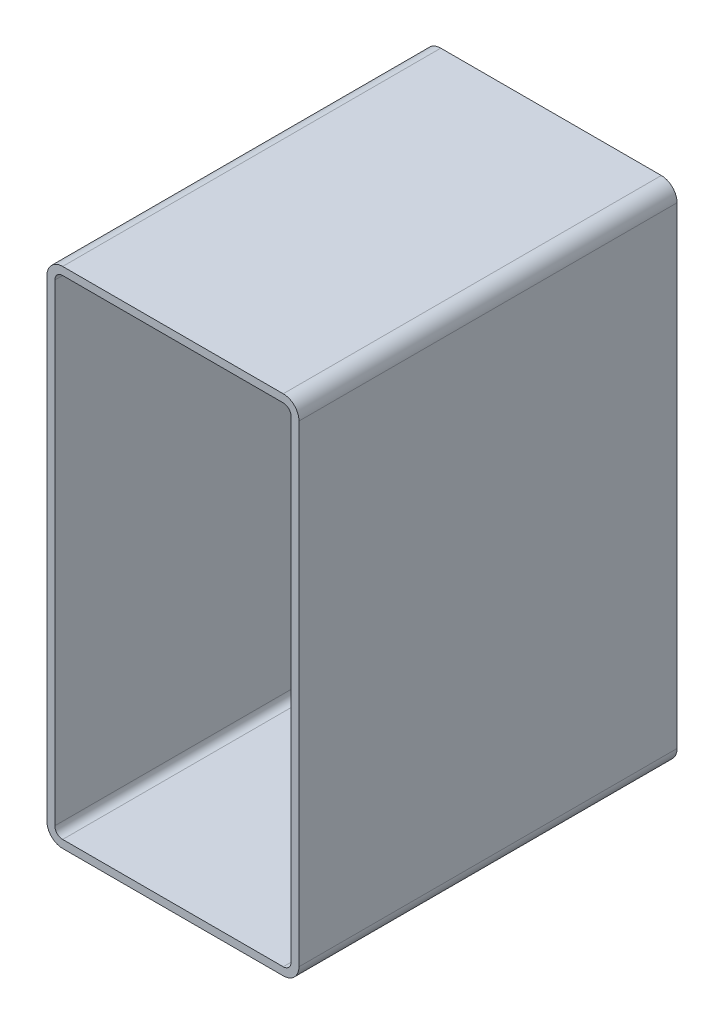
ISO-10303-21;
HEADER;
FILE_DESCRIPTION(('STEP AP214'),'2;1');
FILE_NAME('part.step','',(''),(''),'','','');
FILE_SCHEMA(('AUTOMOTIVE_DESIGN { 1 0 10303 214 1 1 1 1 }'));
ENDSEC;
DATA;
#1=APPLICATION_CONTEXT('core data for automotive mechanical design processes');
#2=APPLICATION_PROTOCOL_DEFINITION('international standard','automotive_design',2000,#1);
#3=PRODUCT_CONTEXT('',#1,'mechanical');
#4=PRODUCT('Part','Part','',(#3));
#5=PRODUCT_RELATED_PRODUCT_CATEGORY('part','',(#4));
#6=PRODUCT_DEFINITION_FORMATION('','',#4);
#7=PRODUCT_DEFINITION_CONTEXT('part definition',#1,'design');
#8=PRODUCT_DEFINITION('design','',#6,#7);
#9=PRODUCT_DEFINITION_SHAPE('','',#8);
#10=(LENGTH_UNIT() NAMED_UNIT(*) SI_UNIT(.MILLI.,.METRE.));
#11=(NAMED_UNIT(*) PLANE_ANGLE_UNIT() SI_UNIT($,.RADIAN.));
#12=(NAMED_UNIT(*) SI_UNIT($,.STERADIAN.) SOLID_ANGLE_UNIT());
#13=UNCERTAINTY_MEASURE_WITH_UNIT(LENGTH_MEASURE(1.E-05),#10,'distance_accuracy_value','');
#14=(GEOMETRIC_REPRESENTATION_CONTEXT(3) GLOBAL_UNCERTAINTY_ASSIGNED_CONTEXT((#13)) GLOBAL_UNIT_ASSIGNED_CONTEXT((#10,
#11,#12)) REPRESENTATION_CONTEXT('',''));
#15=CARTESIAN_POINT('',(0.,0.,0.));
#16=DIRECTION('',(0.,0.,1.));
#17=DIRECTION('',(1.,0.,0.));
#18=AXIS2_PLACEMENT_3D('',#15,#16,#17);
#19=CARTESIAN_POINT('',(14.0909404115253,395.482862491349,304.8));
#20=DIRECTION('',(0.,0.,1.));
#21=DIRECTION('',(1.,0.,0.));
#22=AXIS2_PLACEMENT_3D('',#19,#20,#21);
#23=PLANE('',#22);
#24=CARTESIAN_POINT('',(14.0909404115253,395.482862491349,304.8));
#25=DIRECTION('',(0.,0.,1.));
#26=DIRECTION('',(1.,0.,0.));
#27=AXIS2_PLACEMENT_3D('',#24,#25,#26);
#28=CIRCLE('',#27,12.7);
#29=CARTESIAN_POINT('',(14.0909404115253,408.182862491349,304.8));
#30=VERTEX_POINT('',#29);
#31=CARTESIAN_POINT('',(1.3909404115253,395.482862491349,304.8));
#32=VERTEX_POINT('',#31);
#33=EDGE_CURVE('E211',#30,#32,#28,.T.);
#34=ORIENTED_EDGE('',*,*,#33,.T.);
#35=DIRECTION('',(0.,-1.,0.));
#36=VECTOR('',#35,1.);
#37=CARTESIAN_POINT('',(1.3909404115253,14.4828624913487,304.8));
#38=LINE('',#37,#36);
#39=CARTESIAN_POINT('',(1.3909404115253,14.4828624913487,304.8));
#40=VERTEX_POINT('',#39);
#41=EDGE_CURVE('E214',#32,#40,#38,.T.);
#42=ORIENTED_EDGE('',*,*,#41,.T.);
#43=CARTESIAN_POINT('',(14.0909404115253,14.4828624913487,304.8));
#44=DIRECTION('',(0.,0.,1.));
#45=DIRECTION('',(1.,0.,0.));
#46=AXIS2_PLACEMENT_3D('',#43,#44,#45);
#47=CIRCLE('',#46,12.7);
#48=CARTESIAN_POINT('',(14.0909404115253,1.78286249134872,304.8));
#49=VERTEX_POINT('',#48);
#50=EDGE_CURVE('E217',#40,#49,#47,.T.);
#51=ORIENTED_EDGE('',*,*,#50,.T.);
#52=DIRECTION('',(1.,0.,0.));
#53=VECTOR('',#52,1.);
#54=CARTESIAN_POINT('',(191.890940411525,1.78286249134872,304.8));
#55=LINE('',#54,#53);
#56=CARTESIAN_POINT('',(191.890940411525,1.78286249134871,304.8));
#57=VERTEX_POINT('',#56);
#58=EDGE_CURVE('E219',#49,#57,#55,.T.);
#59=ORIENTED_EDGE('',*,*,#58,.T.);
#60=CARTESIAN_POINT('',(191.890940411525,14.4828624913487,304.8));
#61=DIRECTION('',(0.,0.,1.));
#62=DIRECTION('',(1.,0.,0.));
#63=AXIS2_PLACEMENT_3D('',#60,#61,#62);
#64=CIRCLE('',#63,12.7);
#65=CARTESIAN_POINT('',(204.590940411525,14.4828624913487,304.8));
#66=VERTEX_POINT('',#65);
#67=EDGE_CURVE('E221',#57,#66,#64,.T.);
#68=ORIENTED_EDGE('',*,*,#67,.T.);
#69=DIRECTION('',(0.,1.,0.));
#70=VECTOR('',#69,1.);
#71=CARTESIAN_POINT('',(204.590940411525,395.482862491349,304.8));
#72=LINE('',#71,#70);
#73=CARTESIAN_POINT('',(204.590940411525,395.482862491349,304.8));
#74=VERTEX_POINT('',#73);
#75=EDGE_CURVE('E223',#66,#74,#72,.T.);
#76=ORIENTED_EDGE('',*,*,#75,.T.);
#77=CARTESIAN_POINT('',(191.890940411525,395.482862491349,304.8));
#78=DIRECTION('',(0.,0.,1.));
#79=DIRECTION('',(1.,0.,0.));
#80=AXIS2_PLACEMENT_3D('',#77,#78,#79);
#81=CIRCLE('',#80,12.7);
#82=CARTESIAN_POINT('',(191.890940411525,408.182862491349,304.8));
#83=VERTEX_POINT('',#82);
#84=EDGE_CURVE('E225',#74,#83,#81,.T.);
#85=ORIENTED_EDGE('',*,*,#84,.T.);
#86=DIRECTION('',(-1.,0.,0.));
#87=VECTOR('',#86,1.);
#88=CARTESIAN_POINT('',(14.0909404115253,408.182862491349,304.8));
#89=LINE('',#88,#87);
#90=EDGE_CURVE('E227',#83,#30,#89,.T.);
#91=ORIENTED_EDGE('',*,*,#90,.T.);
#92=EDGE_LOOP('',(#34,#42,#51,#59,#68,#76,#85,#91));
#93=FACE_BOUND('',#92,.T.);
#94=DIRECTION('',(0.,-1.,0.));
#95=VECTOR('',#94,1.);
#96=CARTESIAN_POINT('',(7.7409404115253,14.4828624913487,304.8));
#97=LINE('',#96,#95);
#98=CARTESIAN_POINT('',(7.7409404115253,395.482862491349,304.8));
#99=VERTEX_POINT('',#98);
#100=CARTESIAN_POINT('',(7.7409404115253,14.4828624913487,304.8));
#101=VERTEX_POINT('',#100);
#102=EDGE_CURVE('E154',#99,#101,#97,.T.);
#103=ORIENTED_EDGE('',*,*,#102,.F.);
#104=CARTESIAN_POINT('',(14.0909404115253,395.482862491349,304.8));
#105=DIRECTION('',(0.,0.,1.));
#106=DIRECTION('',(1.,0.,0.));
#107=AXIS2_PLACEMENT_3D('',#104,#105,#106);
#108=CIRCLE('',#107,6.35000000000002);
#109=CARTESIAN_POINT('',(14.0909404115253,401.832862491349,304.8));
#110=VERTEX_POINT('',#109);
#111=EDGE_CURVE('E146',#110,#99,#108,.T.);
#112=ORIENTED_EDGE('',*,*,#111,.F.);
#113=DIRECTION('',(-1.,0.,0.));
#114=VECTOR('',#113,1.);
#115=CARTESIAN_POINT('',(14.0909404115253,401.832862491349,304.8));
#116=LINE('',#115,#114);
#117=CARTESIAN_POINT('',(191.890940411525,401.832862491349,304.8));
#118=VERTEX_POINT('',#117);
#119=EDGE_CURVE('E179',#118,#110,#116,.T.);
#120=ORIENTED_EDGE('',*,*,#119,.F.);
#121=CARTESIAN_POINT('',(191.890940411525,395.482862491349,304.8));
#122=DIRECTION('',(0.,0.,1.));
#123=DIRECTION('',(1.,0.,0.));
#124=AXIS2_PLACEMENT_3D('',#121,#122,#123);
#125=CIRCLE('',#124,6.35000000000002);
#126=CARTESIAN_POINT('',(198.240940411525,395.482862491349,304.8));
#127=VERTEX_POINT('',#126);
#128=EDGE_CURVE('E177',#127,#118,#125,.T.);
#129=ORIENTED_EDGE('',*,*,#128,.F.);
#130=DIRECTION('',(0.,1.,0.));
#131=VECTOR('',#130,1.);
#132=CARTESIAN_POINT('',(198.240940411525,395.482862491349,304.8));
#133=LINE('',#132,#131);
#134=CARTESIAN_POINT('',(198.240940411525,14.4828624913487,304.8));
#135=VERTEX_POINT('',#134);
#136=EDGE_CURVE('E175',#135,#127,#133,.T.);
#137=ORIENTED_EDGE('',*,*,#136,.F.);
#138=CARTESIAN_POINT('',(191.890940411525,14.4828624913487,304.8));
#139=DIRECTION('',(0.,0.,1.));
#140=DIRECTION('',(1.,0.,0.));
#141=AXIS2_PLACEMENT_3D('',#138,#139,#140);
#142=CIRCLE('',#141,6.35000000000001);
#143=CARTESIAN_POINT('',(191.890940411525,8.13286249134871,304.8));
#144=VERTEX_POINT('',#143);
#145=EDGE_CURVE('E173',#144,#135,#142,.T.);
#146=ORIENTED_EDGE('',*,*,#145,.F.);
#147=DIRECTION('',(1.,0.,0.));
#148=VECTOR('',#147,1.);
#149=CARTESIAN_POINT('',(191.890940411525,8.13286249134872,304.8));
#150=LINE('',#149,#148);
#151=CARTESIAN_POINT('',(14.0909404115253,8.13286249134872,304.8));
#152=VERTEX_POINT('',#151);
#153=EDGE_CURVE('E169',#152,#144,#150,.T.);
#154=ORIENTED_EDGE('',*,*,#153,.F.);
#155=CARTESIAN_POINT('',(14.0909404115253,14.4828624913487,304.8));
#156=DIRECTION('',(0.,0.,1.));
#157=DIRECTION('',(1.,0.,0.));
#158=AXIS2_PLACEMENT_3D('',#155,#156,#157);
#159=CIRCLE('',#158,6.35);
#160=EDGE_CURVE('E167',#101,#152,#159,.T.);
#161=ORIENTED_EDGE('',*,*,#160,.F.);
#162=EDGE_LOOP('',(#103,#112,#120,#129,#137,#146,#154,#161));
#163=FACE_BOUND('',#162,.T.);
#164=ADVANCED_FACE('F33',(#93,#163),#23,.T.);
#165=CARTESIAN_POINT('',(14.0909404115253,395.482862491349,0.));
#166=DIRECTION('',(0.,0.,1.));
#167=DIRECTION('',(1.,0.,0.));
#168=AXIS2_PLACEMENT_3D('',#165,#166,#167);
#169=PLANE('',#168);
#170=CARTESIAN_POINT('',(14.0909404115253,395.482862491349,0.));
#171=DIRECTION('',(0.,0.,1.));
#172=DIRECTION('',(1.,0.,0.));
#173=AXIS2_PLACEMENT_3D('',#170,#171,#172);
#174=CIRCLE('',#173,12.7);
#175=CARTESIAN_POINT('',(14.0909404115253,408.182862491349,0.));
#176=VERTEX_POINT('',#175);
#177=CARTESIAN_POINT('',(1.3909404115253,395.482862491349,0.));
#178=VERTEX_POINT('',#177);
#179=EDGE_CURVE('E162',#176,#178,#174,.T.);
#180=ORIENTED_EDGE('',*,*,#179,.F.);
#181=DIRECTION('',(-1.,0.,0.));
#182=VECTOR('',#181,1.);
#183=CARTESIAN_POINT('',(14.0909404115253,408.182862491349,0.));
#184=LINE('',#183,#182);
#185=CARTESIAN_POINT('',(191.890940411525,408.182862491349,0.));
#186=VERTEX_POINT('',#185);
#187=EDGE_CURVE('E215',#186,#176,#184,.T.);
#188=ORIENTED_EDGE('',*,*,#187,.F.);
#189=CARTESIAN_POINT('',(191.890940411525,395.482862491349,0.));
#190=DIRECTION('',(0.,0.,1.));
#191=DIRECTION('',(1.,0.,0.));
#192=AXIS2_PLACEMENT_3D('',#189,#190,#191);
#193=CIRCLE('',#192,12.7);
#194=CARTESIAN_POINT('',(204.590940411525,395.482862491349,0.));
#195=VERTEX_POINT('',#194);
#196=EDGE_CURVE('E242',#195,#186,#193,.T.);
#197=ORIENTED_EDGE('',*,*,#196,.F.);
#198=DIRECTION('',(0.,1.,0.));
#199=VECTOR('',#198,1.);
#200=CARTESIAN_POINT('',(204.590940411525,395.482862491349,0.));
#201=LINE('',#200,#199);
#202=CARTESIAN_POINT('',(204.590940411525,14.4828624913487,0.));
#203=VERTEX_POINT('',#202);
#204=EDGE_CURVE('E240',#203,#195,#201,.T.);
#205=ORIENTED_EDGE('',*,*,#204,.F.);
#206=CARTESIAN_POINT('',(191.890940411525,14.4828624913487,0.));
#207=DIRECTION('',(0.,0.,1.));
#208=DIRECTION('',(1.,0.,0.));
#209=AXIS2_PLACEMENT_3D('',#206,#207,#208);
#210=CIRCLE('',#209,12.7);
#211=CARTESIAN_POINT('',(191.890940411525,1.78286249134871,0.));
#212=VERTEX_POINT('',#211);
#213=EDGE_CURVE('E238',#212,#203,#210,.T.);
#214=ORIENTED_EDGE('',*,*,#213,.F.);
#215=DIRECTION('',(1.,0.,0.));
#216=VECTOR('',#215,1.);
#217=CARTESIAN_POINT('',(191.890940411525,1.78286249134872,0.));
#218=LINE('',#217,#216);
#219=CARTESIAN_POINT('',(14.0909404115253,1.78286249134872,0.));
#220=VERTEX_POINT('',#219);
#221=EDGE_CURVE('E236',#220,#212,#218,.T.);
#222=ORIENTED_EDGE('',*,*,#221,.F.);
#223=CARTESIAN_POINT('',(14.0909404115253,14.4828624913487,0.));
#224=DIRECTION('',(0.,0.,1.));
#225=DIRECTION('',(1.,0.,0.));
#226=AXIS2_PLACEMENT_3D('',#223,#224,#225);
#227=CIRCLE('',#226,12.7);
#228=CARTESIAN_POINT('',(1.3909404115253,14.4828624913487,0.));
#229=VERTEX_POINT('',#228);
#230=EDGE_CURVE('E234',#229,#220,#227,.T.);
#231=ORIENTED_EDGE('',*,*,#230,.F.);
#232=DIRECTION('',(0.,-1.,0.));
#233=VECTOR('',#232,1.);
#234=CARTESIAN_POINT('',(1.3909404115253,14.4828624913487,0.));
#235=LINE('',#234,#233);
#236=EDGE_CURVE('E232',#178,#229,#235,.T.);
#237=ORIENTED_EDGE('',*,*,#236,.F.);
#238=EDGE_LOOP('',(#180,#188,#197,#205,#214,#222,#231,#237));
#239=FACE_BOUND('',#238,.T.);
#240=CARTESIAN_POINT('',(14.0909404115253,395.482862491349,0.));
#241=DIRECTION('',(0.,0.,1.));
#242=DIRECTION('',(1.,0.,0.));
#243=AXIS2_PLACEMENT_3D('',#240,#241,#242);
#244=CIRCLE('',#243,6.35000000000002);
#245=CARTESIAN_POINT('',(14.0909404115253,401.832862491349,0.));
#246=VERTEX_POINT('',#245);
#247=CARTESIAN_POINT('',(7.7409404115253,395.482862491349,0.));
#248=VERTEX_POINT('',#247);
#249=EDGE_CURVE('E56',#246,#248,#244,.T.);
#250=ORIENTED_EDGE('',*,*,#249,.T.);
#251=DIRECTION('',(0.,-1.,0.));
#252=VECTOR('',#251,1.);
#253=CARTESIAN_POINT('',(7.7409404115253,14.4828624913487,0.));
#254=LINE('',#253,#252);
#255=CARTESIAN_POINT('',(7.7409404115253,14.4828624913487,0.));
#256=VERTEX_POINT('',#255);
#257=EDGE_CURVE('E161',#248,#256,#254,.T.);
#258=ORIENTED_EDGE('',*,*,#257,.T.);
#259=CARTESIAN_POINT('',(14.0909404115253,14.4828624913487,0.));
#260=DIRECTION('',(0.,0.,1.));
#261=DIRECTION('',(1.,0.,0.));
#262=AXIS2_PLACEMENT_3D('',#259,#260,#261);
#263=CIRCLE('',#262,6.35);
#264=CARTESIAN_POINT('',(14.0909404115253,8.13286249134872,0.));
#265=VERTEX_POINT('',#264);
#266=EDGE_CURVE('E183',#256,#265,#263,.T.);
#267=ORIENTED_EDGE('',*,*,#266,.T.);
#268=DIRECTION('',(1.,0.,0.));
#269=VECTOR('',#268,1.);
#270=CARTESIAN_POINT('',(191.890940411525,8.13286249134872,0.));
#271=LINE('',#270,#269);
#272=CARTESIAN_POINT('',(191.890940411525,8.13286249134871,0.));
#273=VERTEX_POINT('',#272);
#274=EDGE_CURVE('E186',#265,#273,#271,.T.);
#275=ORIENTED_EDGE('',*,*,#274,.T.);
#276=CARTESIAN_POINT('',(191.890940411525,14.4828624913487,0.));
#277=DIRECTION('',(0.,0.,1.));
#278=DIRECTION('',(1.,0.,0.));
#279=AXIS2_PLACEMENT_3D('',#276,#277,#278);
#280=CIRCLE('',#279,6.35000000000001);
#281=CARTESIAN_POINT('',(198.240940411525,14.4828624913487,0.));
#282=VERTEX_POINT('',#281);
#283=EDGE_CURVE('E189',#273,#282,#280,.T.);
#284=ORIENTED_EDGE('',*,*,#283,.T.);
#285=DIRECTION('',(0.,1.,0.));
#286=VECTOR('',#285,1.);
#287=CARTESIAN_POINT('',(198.240940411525,395.482862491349,0.));
#288=LINE('',#287,#286);
#289=CARTESIAN_POINT('',(198.240940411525,395.482862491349,0.));
#290=VERTEX_POINT('',#289);
#291=EDGE_CURVE('E192',#282,#290,#288,.T.);
#292=ORIENTED_EDGE('',*,*,#291,.T.);
#293=CARTESIAN_POINT('',(191.890940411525,395.482862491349,0.));
#294=DIRECTION('',(0.,0.,1.));
#295=DIRECTION('',(1.,0.,0.));
#296=AXIS2_PLACEMENT_3D('',#293,#294,#295);
#297=CIRCLE('',#296,6.35000000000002);
#298=CARTESIAN_POINT('',(191.890940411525,401.832862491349,0.));
#299=VERTEX_POINT('',#298);
#300=EDGE_CURVE('E195',#290,#299,#297,.T.);
#301=ORIENTED_EDGE('',*,*,#300,.T.);
#302=DIRECTION('',(-1.,0.,0.));
#303=VECTOR('',#302,1.);
#304=CARTESIAN_POINT('',(14.0909404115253,401.832862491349,0.));
#305=LINE('',#304,#303);
#306=EDGE_CURVE('E155',#299,#246,#305,.T.);
#307=ORIENTED_EDGE('',*,*,#306,.T.);
#308=EDGE_LOOP('',(#250,#258,#267,#275,#284,#292,#301,#307));
#309=FACE_BOUND('',#308,.T.);
#310=ADVANCED_FACE('F272',(#239,#309),#169,.F.);
#311=CARTESIAN_POINT('',(14.0909404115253,395.482862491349,304.8));
#312=DIRECTION('',(0.,0.,-1.));
#313=DIRECTION('',(-1.,0.,0.));
#314=AXIS2_PLACEMENT_3D('',#311,#312,#313);
#315=CYLINDRICAL_SURFACE('',#314,12.7);
#316=ORIENTED_EDGE('',*,*,#179,.T.);
#317=DIRECTION('',(0.,0.,-1.));
#318=VECTOR('',#317,1.);
#319=CARTESIAN_POINT('',(1.3909404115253,395.482862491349,304.8));
#320=LINE('',#319,#318);
#321=EDGE_CURVE('E11',#32,#178,#320,.T.);
#322=ORIENTED_EDGE('',*,*,#321,.F.);
#323=ORIENTED_EDGE('',*,*,#33,.F.);
#324=DIRECTION('',(0.,0.,-1.));
#325=VECTOR('',#324,1.);
#326=CARTESIAN_POINT('',(14.0909404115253,408.182862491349,304.8));
#327=LINE('',#326,#325);
#328=EDGE_CURVE('E229',#30,#176,#327,.T.);
#329=ORIENTED_EDGE('',*,*,#328,.T.);
#330=EDGE_LOOP('',(#316,#322,#323,#329));
#331=FACE_BOUND('',#330,.T.);
#332=ADVANCED_FACE('F35',(#331),#315,.T.);
#333=CARTESIAN_POINT('',(1.3909404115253,14.4828624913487,304.8));
#334=DIRECTION('',(1.,0.,0.));
#335=DIRECTION('',(0.,0.,-1.));
#336=AXIS2_PLACEMENT_3D('',#333,#334,#335);
#337=PLANE('',#336);
#338=ORIENTED_EDGE('',*,*,#236,.T.);
#339=DIRECTION('',(0.,0.,-1.));
#340=VECTOR('',#339,1.);
#341=CARTESIAN_POINT('',(1.3909404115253,14.4828624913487,304.8));
#342=LINE('',#341,#340);
#343=EDGE_CURVE('E41',#40,#229,#342,.T.);
#344=ORIENTED_EDGE('',*,*,#343,.F.);
#345=ORIENTED_EDGE('',*,*,#41,.F.);
#346=ORIENTED_EDGE('',*,*,#321,.T.);
#347=EDGE_LOOP('',(#338,#344,#345,#346));
#348=FACE_BOUND('',#347,.T.);
#349=ADVANCED_FACE('F289',(#348),#337,.F.);
#350=CARTESIAN_POINT('',(14.0909404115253,14.4828624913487,304.8));
#351=DIRECTION('',(0.,0.,-1.));
#352=DIRECTION('',(-1.,0.,0.));
#353=AXIS2_PLACEMENT_3D('',#350,#351,#352);
#354=CYLINDRICAL_SURFACE('',#353,12.7);
#355=ORIENTED_EDGE('',*,*,#230,.T.);
#356=DIRECTION('',(0.,0.,-1.));
#357=VECTOR('',#356,1.);
#358=CARTESIAN_POINT('',(14.0909404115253,1.78286249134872,304.8));
#359=LINE('',#358,#357);
#360=EDGE_CURVE('E259',#49,#220,#359,.T.);
#361=ORIENTED_EDGE('',*,*,#360,.F.);
#362=ORIENTED_EDGE('',*,*,#50,.F.);
#363=ORIENTED_EDGE('',*,*,#343,.T.);
#364=EDGE_LOOP('',(#355,#361,#362,#363));
#365=FACE_BOUND('',#364,.T.);
#366=ADVANCED_FACE('F266',(#365),#354,.T.);
#367=CARTESIAN_POINT('',(191.890940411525,1.78286249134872,304.8));
#368=DIRECTION('',(0.,1.,0.));
#369=DIRECTION('',(0.,0.,1.));
#370=AXIS2_PLACEMENT_3D('',#367,#368,#369);
#371=PLANE('',#370);
#372=ORIENTED_EDGE('',*,*,#221,.T.);
#373=DIRECTION('',(0.,0.,-1.));
#374=VECTOR('',#373,1.);
#375=CARTESIAN_POINT('',(191.890940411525,1.78286249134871,304.8));
#376=LINE('',#375,#374);
#377=EDGE_CURVE('E256',#57,#212,#376,.T.);
#378=ORIENTED_EDGE('',*,*,#377,.F.);
#379=ORIENTED_EDGE('',*,*,#58,.F.);
#380=ORIENTED_EDGE('',*,*,#360,.T.);
#381=EDGE_LOOP('',(#372,#378,#379,#380));
#382=FACE_BOUND('',#381,.T.);
#383=ADVANCED_FACE('F278',(#382),#371,.F.);
#384=CARTESIAN_POINT('',(191.890940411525,14.4828624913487,304.8));
#385=DIRECTION('',(0.,0.,-1.));
#386=DIRECTION('',(-1.,0.,0.));
#387=AXIS2_PLACEMENT_3D('',#384,#385,#386);
#388=CYLINDRICAL_SURFACE('',#387,12.7);
#389=ORIENTED_EDGE('',*,*,#213,.T.);
#390=DIRECTION('',(0.,0.,-1.));
#391=VECTOR('',#390,1.);
#392=CARTESIAN_POINT('',(204.590940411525,14.4828624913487,304.8));
#393=LINE('',#392,#391);
#394=EDGE_CURVE('E253',#66,#203,#393,.T.);
#395=ORIENTED_EDGE('',*,*,#394,.F.);
#396=ORIENTED_EDGE('',*,*,#67,.F.);
#397=ORIENTED_EDGE('',*,*,#377,.T.);
#398=EDGE_LOOP('',(#389,#395,#396,#397));
#399=FACE_BOUND('',#398,.T.);
#400=ADVANCED_FACE('F282',(#399),#388,.T.);
#401=CARTESIAN_POINT('',(204.590940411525,395.482862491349,304.8));
#402=DIRECTION('',(-1.,0.,0.));
#403=DIRECTION('',(0.,0.,1.));
#404=AXIS2_PLACEMENT_3D('',#401,#402,#403);
#405=PLANE('',#404);
#406=ORIENTED_EDGE('',*,*,#204,.T.);
#407=DIRECTION('',(0.,0.,-1.));
#408=VECTOR('',#407,1.);
#409=CARTESIAN_POINT('',(204.590940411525,395.482862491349,304.8));
#410=LINE('',#409,#408);
#411=EDGE_CURVE('E250',#74,#195,#410,.T.);
#412=ORIENTED_EDGE('',*,*,#411,.F.);
#413=ORIENTED_EDGE('',*,*,#75,.F.);
#414=ORIENTED_EDGE('',*,*,#394,.T.);
#415=EDGE_LOOP('',(#406,#412,#413,#414));
#416=FACE_BOUND('',#415,.T.);
#417=ADVANCED_FACE('F302',(#416),#405,.F.);
#418=CARTESIAN_POINT('',(191.890940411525,395.482862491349,304.8));
#419=DIRECTION('',(0.,0.,-1.));
#420=DIRECTION('',(-1.,0.,0.));
#421=AXIS2_PLACEMENT_3D('',#418,#419,#420);
#422=CYLINDRICAL_SURFACE('',#421,12.7);
#423=ORIENTED_EDGE('',*,*,#196,.T.);
#424=DIRECTION('',(0.,0.,-1.));
#425=VECTOR('',#424,1.);
#426=CARTESIAN_POINT('',(191.890940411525,408.182862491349,304.8));
#427=LINE('',#426,#425);
#428=EDGE_CURVE('E247',#83,#186,#427,.T.);
#429=ORIENTED_EDGE('',*,*,#428,.F.);
#430=ORIENTED_EDGE('',*,*,#84,.F.);
#431=ORIENTED_EDGE('',*,*,#411,.T.);
#432=EDGE_LOOP('',(#423,#429,#430,#431));
#433=FACE_BOUND('',#432,.T.);
#434=ADVANCED_FACE('F300',(#433),#422,.T.);
#435=CARTESIAN_POINT('',(14.0909404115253,408.182862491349,304.8));
#436=DIRECTION('',(0.,-1.,0.));
#437=DIRECTION('',(0.,0.,-1.));
#438=AXIS2_PLACEMENT_3D('',#435,#436,#437);
#439=PLANE('',#438);
#440=ORIENTED_EDGE('',*,*,#187,.T.);
#441=ORIENTED_EDGE('',*,*,#328,.F.);
#442=ORIENTED_EDGE('',*,*,#90,.F.);
#443=ORIENTED_EDGE('',*,*,#428,.T.);
#444=EDGE_LOOP('',(#440,#441,#442,#443));
#445=FACE_BOUND('',#444,.T.);
#446=ADVANCED_FACE('F295',(#445),#439,.F.);
#447=CARTESIAN_POINT('',(14.0909404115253,395.482862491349,304.8));
#448=DIRECTION('',(0.,0.,-1.));
#449=DIRECTION('',(-1.,0.,0.));
#450=AXIS2_PLACEMENT_3D('',#447,#448,#449);
#451=CYLINDRICAL_SURFACE('',#450,6.35000000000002);
#452=ORIENTED_EDGE('',*,*,#249,.F.);
#453=DIRECTION('',(0.,0.,-1.));
#454=VECTOR('',#453,1.);
#455=CARTESIAN_POINT('',(14.0909404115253,401.832862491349,304.8));
#456=LINE('',#455,#454);
#457=EDGE_CURVE('E150',#110,#246,#456,.T.);
#458=ORIENTED_EDGE('',*,*,#457,.F.);
#459=ORIENTED_EDGE('',*,*,#111,.T.);
#460=DIRECTION('',(0.,0.,-1.));
#461=VECTOR('',#460,1.);
#462=CARTESIAN_POINT('',(7.7409404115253,395.482862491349,304.8));
#463=LINE('',#462,#461);
#464=EDGE_CURVE('E149',#99,#248,#463,.T.);
#465=ORIENTED_EDGE('',*,*,#464,.T.);
#466=EDGE_LOOP('',(#452,#458,#459,#465));
#467=FACE_BOUND('',#466,.T.);
#468=ADVANCED_FACE('F148',(#467),#451,.F.);
#469=CARTESIAN_POINT('',(7.7409404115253,14.4828624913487,304.8));
#470=DIRECTION('',(1.,0.,0.));
#471=DIRECTION('',(0.,0.,-1.));
#472=AXIS2_PLACEMENT_3D('',#469,#470,#471);
#473=PLANE('',#472);
#474=ORIENTED_EDGE('',*,*,#257,.F.);
#475=ORIENTED_EDGE('',*,*,#464,.F.);
#476=ORIENTED_EDGE('',*,*,#102,.T.);
#477=DIRECTION('',(0.,0.,-1.));
#478=VECTOR('',#477,1.);
#479=CARTESIAN_POINT('',(7.7409404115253,14.4828624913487,304.8));
#480=LINE('',#479,#478);
#481=EDGE_CURVE('E163',#101,#256,#480,.T.);
#482=ORIENTED_EDGE('',*,*,#481,.T.);
#483=EDGE_LOOP('',(#474,#475,#476,#482));
#484=FACE_BOUND('',#483,.T.);
#485=ADVANCED_FACE('F158',(#484),#473,.T.);
#486=CARTESIAN_POINT('',(14.0909404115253,14.4828624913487,304.8));
#487=DIRECTION('',(0.,0.,-1.));
#488=DIRECTION('',(-1.,0.,0.));
#489=AXIS2_PLACEMENT_3D('',#486,#487,#488);
#490=CYLINDRICAL_SURFACE('',#489,6.35);
#491=ORIENTED_EDGE('',*,*,#266,.F.);
#492=ORIENTED_EDGE('',*,*,#481,.F.);
#493=ORIENTED_EDGE('',*,*,#160,.T.);
#494=DIRECTION('',(0.,0.,-1.));
#495=VECTOR('',#494,1.);
#496=CARTESIAN_POINT('',(14.0909404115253,8.13286249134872,304.8));
#497=LINE('',#496,#495);
#498=EDGE_CURVE('E208',#152,#265,#497,.T.);
#499=ORIENTED_EDGE('',*,*,#498,.T.);
#500=EDGE_LOOP('',(#491,#492,#493,#499));
#501=FACE_BOUND('',#500,.T.);
#502=ADVANCED_FACE('F327',(#501),#490,.F.);
#503=CARTESIAN_POINT('',(191.890940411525,8.13286249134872,304.8));
#504=DIRECTION('',(0.,1.,0.));
#505=DIRECTION('',(0.,0.,1.));
#506=AXIS2_PLACEMENT_3D('',#503,#504,#505);
#507=PLANE('',#506);
#508=ORIENTED_EDGE('',*,*,#274,.F.);
#509=ORIENTED_EDGE('',*,*,#498,.F.);
#510=ORIENTED_EDGE('',*,*,#153,.T.);
#511=DIRECTION('',(0.,0.,-1.));
#512=VECTOR('',#511,1.);
#513=CARTESIAN_POINT('',(191.890940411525,8.13286249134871,304.8));
#514=LINE('',#513,#512);
#515=EDGE_CURVE('E206',#144,#273,#514,.T.);
#516=ORIENTED_EDGE('',*,*,#515,.T.);
#517=EDGE_LOOP('',(#508,#509,#510,#516));
#518=FACE_BOUND('',#517,.T.);
#519=ADVANCED_FACE('F331',(#518),#507,.T.);
#520=CARTESIAN_POINT('',(191.890940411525,14.4828624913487,304.8));
#521=DIRECTION('',(0.,0.,-1.));
#522=DIRECTION('',(-1.,0.,0.));
#523=AXIS2_PLACEMENT_3D('',#520,#521,#522);
#524=CYLINDRICAL_SURFACE('',#523,6.35000000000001);
#525=ORIENTED_EDGE('',*,*,#283,.F.);
#526=ORIENTED_EDGE('',*,*,#515,.F.);
#527=ORIENTED_EDGE('',*,*,#145,.T.);
#528=DIRECTION('',(0.,0.,-1.));
#529=VECTOR('',#528,1.);
#530=CARTESIAN_POINT('',(198.240940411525,14.4828624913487,304.8));
#531=LINE('',#530,#529);
#532=EDGE_CURVE('E204',#135,#282,#531,.T.);
#533=ORIENTED_EDGE('',*,*,#532,.T.);
#534=EDGE_LOOP('',(#525,#526,#527,#533));
#535=FACE_BOUND('',#534,.T.);
#536=ADVANCED_FACE('F337',(#535),#524,.F.);
#537=CARTESIAN_POINT('',(198.240940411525,395.482862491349,304.8));
#538=DIRECTION('',(-1.,0.,0.));
#539=DIRECTION('',(0.,0.,1.));
#540=AXIS2_PLACEMENT_3D('',#537,#538,#539);
#541=PLANE('',#540);
#542=ORIENTED_EDGE('',*,*,#291,.F.);
#543=ORIENTED_EDGE('',*,*,#532,.F.);
#544=ORIENTED_EDGE('',*,*,#136,.T.);
#545=DIRECTION('',(0.,0.,-1.));
#546=VECTOR('',#545,1.);
#547=CARTESIAN_POINT('',(198.240940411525,395.482862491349,304.8));
#548=LINE('',#547,#546);
#549=EDGE_CURVE('E202',#127,#290,#548,.T.);
#550=ORIENTED_EDGE('',*,*,#549,.T.);
#551=EDGE_LOOP('',(#542,#543,#544,#550));
#552=FACE_BOUND('',#551,.T.);
#553=ADVANCED_FACE('F341',(#552),#541,.T.);
#554=CARTESIAN_POINT('',(191.890940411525,395.482862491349,304.8));
#555=DIRECTION('',(0.,0.,-1.));
#556=DIRECTION('',(-1.,0.,0.));
#557=AXIS2_PLACEMENT_3D('',#554,#555,#556);
#558=CYLINDRICAL_SURFACE('',#557,6.35000000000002);
#559=ORIENTED_EDGE('',*,*,#300,.F.);
#560=ORIENTED_EDGE('',*,*,#549,.F.);
#561=ORIENTED_EDGE('',*,*,#128,.T.);
#562=DIRECTION('',(0.,0.,-1.));
#563=VECTOR('',#562,1.);
#564=CARTESIAN_POINT('',(191.890940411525,401.832862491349,304.8));
#565=LINE('',#564,#563);
#566=EDGE_CURVE('E48',#118,#299,#565,.T.);
#567=ORIENTED_EDGE('',*,*,#566,.T.);
#568=EDGE_LOOP('',(#559,#560,#561,#567));
#569=FACE_BOUND('',#568,.T.);
#570=ADVANCED_FACE('F345',(#569),#558,.F.);
#571=CARTESIAN_POINT('',(14.0909404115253,401.832862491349,304.8));
#572=DIRECTION('',(0.,-1.,0.));
#573=DIRECTION('',(0.,0.,-1.));
#574=AXIS2_PLACEMENT_3D('',#571,#572,#573);
#575=PLANE('',#574);
#576=ORIENTED_EDGE('',*,*,#306,.F.);
#577=ORIENTED_EDGE('',*,*,#566,.F.);
#578=ORIENTED_EDGE('',*,*,#119,.T.);
#579=ORIENTED_EDGE('',*,*,#457,.T.);
#580=EDGE_LOOP('',(#576,#577,#578,#579));
#581=FACE_BOUND('',#580,.T.);
#582=ADVANCED_FACE('F349',(#581),#575,.T.);
#583=CLOSED_SHELL('',(#164,#310,#332,#349,#366,#383,#400,#417,#434,#446,#468,#485,#502,#519,
#536,#553,#570,#582));
#584=MANIFOLD_SOLID_BREP('B2',#583);
#585=ADVANCED_BREP_SHAPE_REPRESENTATION('',(#18,#584),#14);
#586=SHAPE_DEFINITION_REPRESENTATION(#9,#585);
ENDSEC;
END-ISO-10303-21;
